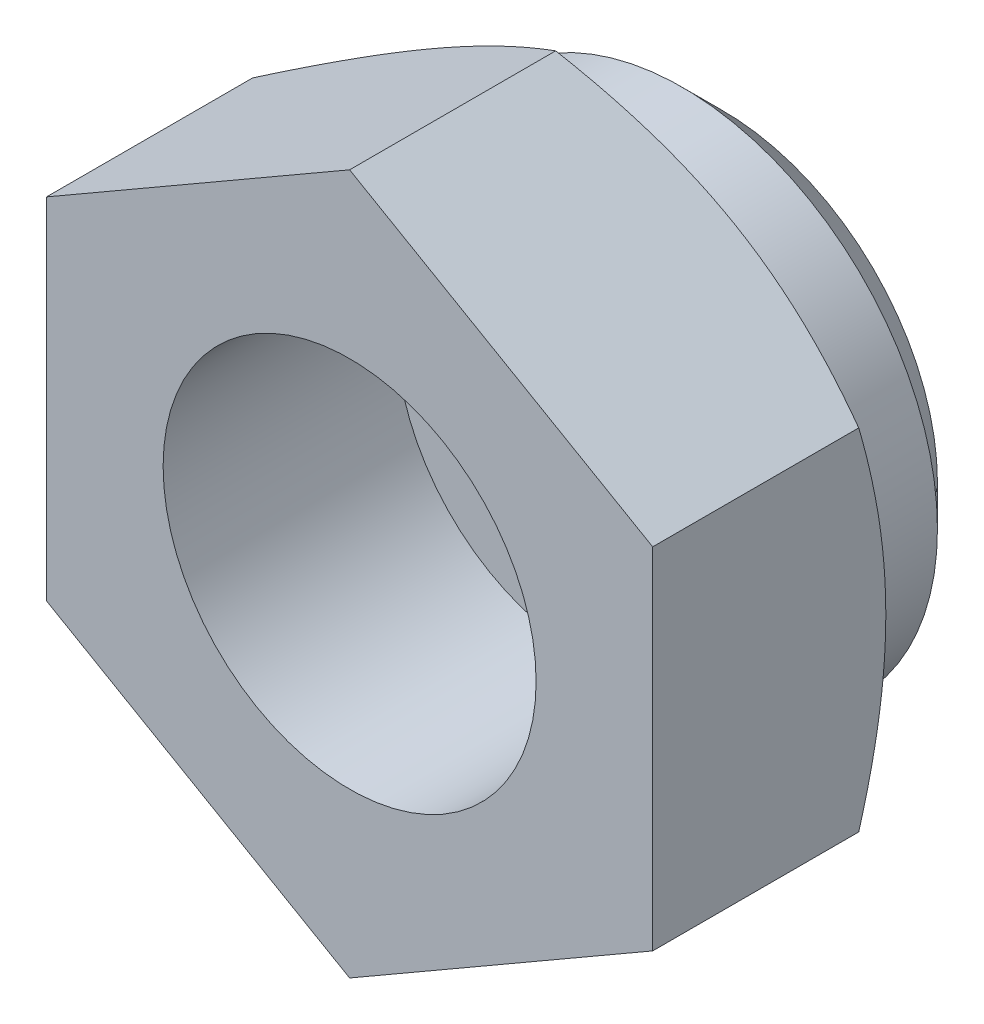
ISO-10303-21;
HEADER;
FILE_DESCRIPTION(('STEP AP214'),'2;1');
FILE_NAME('part.step','',(''),(''),'','','');
FILE_SCHEMA(('AUTOMOTIVE_DESIGN { 1 0 10303 214 1 1 1 1 }'));
ENDSEC;
DATA;
#1=APPLICATION_CONTEXT('core data for automotive mechanical design processes');
#2=APPLICATION_PROTOCOL_DEFINITION('international standard','automotive_design',2000,#1);
#3=PRODUCT_CONTEXT('',#1,'mechanical');
#4=PRODUCT('Part','Part','',(#3));
#5=PRODUCT_RELATED_PRODUCT_CATEGORY('part','',(#4));
#6=PRODUCT_DEFINITION_FORMATION('','',#4);
#7=PRODUCT_DEFINITION_CONTEXT('part definition',#1,'design');
#8=PRODUCT_DEFINITION('design','',#6,#7);
#9=PRODUCT_DEFINITION_SHAPE('','',#8);
#10=(LENGTH_UNIT() NAMED_UNIT(*) SI_UNIT(.MILLI.,.METRE.));
#11=(NAMED_UNIT(*) PLANE_ANGLE_UNIT() SI_UNIT($,.RADIAN.));
#12=(NAMED_UNIT(*) SI_UNIT($,.STERADIAN.) SOLID_ANGLE_UNIT());
#13=UNCERTAINTY_MEASURE_WITH_UNIT(LENGTH_MEASURE(1.E-05),#10,'distance_accuracy_value','');
#14=(GEOMETRIC_REPRESENTATION_CONTEXT(3) GLOBAL_UNCERTAINTY_ASSIGNED_CONTEXT((#13)) GLOBAL_UNIT_ASSIGNED_CONTEXT((#10,
#11,#12)) REPRESENTATION_CONTEXT('',''));
#15=CARTESIAN_POINT('',(0.,0.,0.));
#16=DIRECTION('',(0.,0.,1.));
#17=DIRECTION('',(1.,0.,0.));
#18=AXIS2_PLACEMENT_3D('',#15,#16,#17);
#19=CARTESIAN_POINT('',(6.5,3.75277674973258,-7.));
#20=DIRECTION('',(0.499999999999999,0.866025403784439,0.));
#21=DIRECTION('',(-0.866025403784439,0.499999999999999,0.));
#22=AXIS2_PLACEMENT_3D('',#19,#20,#21);
#23=PLANE('',#22);
#24=DIRECTION('',(0.,0.,1.));
#25=VECTOR('',#24,1.);
#26=CARTESIAN_POINT('',(0.,7.50555349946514,-7.));
#27=LINE('',#26,#25);
#28=CARTESIAN_POINT('',(0.,7.50555349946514,-6.41944341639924));
#29=VERTEX_POINT('',#28);
#30=CARTESIAN_POINT('',(0.,7.50555349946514,-2.));
#31=VERTEX_POINT('',#30);
#32=EDGE_CURVE('E125',#29,#31,#27,.T.);
#33=ORIENTED_EDGE('',*,*,#32,.T.);
#34=DIRECTION('',(0.866025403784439,-0.499999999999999,0.));
#35=VECTOR('',#34,1.);
#36=CARTESIAN_POINT('',(6.5,3.75277674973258,-2.));
#37=LINE('',#36,#35);
#38=CARTESIAN_POINT('',(6.5,3.75277674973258,-2.));
#39=VERTEX_POINT('',#38);
#40=EDGE_CURVE('E45',#31,#39,#37,.T.);
#41=ORIENTED_EDGE('',*,*,#40,.T.);
#42=DIRECTION('',(0.,0.,1.));
#43=VECTOR('',#42,1.);
#44=CARTESIAN_POINT('',(6.5,3.75277674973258,-7.));
#45=LINE('',#44,#43);
#46=CARTESIAN_POINT('',(6.5,3.75277674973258,-6.41944341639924));
#47=VERTEX_POINT('',#46);
#48=EDGE_CURVE('E137',#47,#39,#45,.T.);
#49=ORIENTED_EDGE('',*,*,#48,.F.);
#50=CARTESIAN_POINT('',(-0.0002,7.50566896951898,-6.41937674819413));
#51=CARTESIAN_POINT('',(0.142677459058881,7.42317863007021,-6.46699557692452));
#52=CARTESIAN_POINT('',(0.286087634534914,7.34038072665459,-6.5124532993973));
#53=CARTESIAN_POINT('',(0.574072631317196,7.17411251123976,-6.59845131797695));
#54=CARTESIAN_POINT('',(0.718647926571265,7.09064192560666,-6.63898949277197));
#55=CARTESIAN_POINT('',(1.15468865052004,6.8388936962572,-6.75242899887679));
#56=CARTESIAN_POINT('',(1.44787528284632,6.66962231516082,-6.81695219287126));
#57=CARTESIAN_POINT('',(1.88662374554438,6.41631077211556,-6.89261341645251));
#58=CARTESIAN_POINT('',(2.03087463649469,6.33302748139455,-6.91416714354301));
#59=CARTESIAN_POINT('',(2.32002821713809,6.16608458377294,-6.95030968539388));
#60=CARTESIAN_POINT('',(2.46493084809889,6.08242501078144,-6.96489911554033));
#61=CARTESIAN_POINT('',(2.75498777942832,5.91496056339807,-6.98674124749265));
#62=CARTESIAN_POINT('',(2.90014160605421,5.83115596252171,-6.99400227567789));
#63=CARTESIAN_POINT('',(3.19057533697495,5.66347396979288,-7.00103969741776));
#64=CARTESIAN_POINT('',(3.33585523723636,5.57959658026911,-7.00081632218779));
#65=CARTESIAN_POINT('',(3.7338759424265,5.34979921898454,-6.98991654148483));
#66=CARTESIAN_POINT('',(3.98648646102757,5.20395446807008,-6.97161818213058));
#67=CARTESIAN_POINT('',(4.49002967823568,4.91323365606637,-6.91359365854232));
#68=CARTESIAN_POINT('',(4.74096060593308,4.76835861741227,-6.87384766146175));
#69=CARTESIAN_POINT('',(5.24551722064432,4.47705272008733,-6.77449409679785));
#70=CARTESIAN_POINT('',(5.49907924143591,4.33065861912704,-6.71446557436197));
#71=CARTESIAN_POINT('',(6.00242193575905,4.04005357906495,-6.57822500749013));
#72=CARTESIAN_POINT('',(6.25220905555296,3.89583891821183,-6.50204496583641));
#73=CARTESIAN_POINT('',(6.5002,3.75266127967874,-6.41937674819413));
#74=B_SPLINE_CURVE_WITH_KNOTS('',3,(#50,#51,#52,#53,#54,#55,#56,#57,#58,#59,#60,#61,#62,#63,#64,
#65,#66,#67,#68,#69,#70,#71,#72,#73),.UNSPECIFIED.,.F.,.F.,(4,2,2,2,2,2,2,2,2,2,2,4),(0.,
0.515105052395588,1.03043143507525,2.06322554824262,2.56697389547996,3.07067772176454,
3.57380860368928,4.0769239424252,4.9527935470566,5.82947446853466,6.72559912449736,
7.61996451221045),.UNSPECIFIED.);
#75=CARTESIAN_POINT('',(3.25,5.62916512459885,-7.));
#76=VERTEX_POINT('',#75);
#77=EDGE_CURVE('E140',#76,#47,#74,.T.);
#78=ORIENTED_EDGE('',*,*,#77,.F.);
#79=EDGE_CURVE('E129',#29,#76,#74,.T.);
#80=ORIENTED_EDGE('',*,*,#79,.F.);
#81=EDGE_LOOP('',(#33,#41,#49,#78,#80));
#82=FACE_BOUND('',#81,.T.);
#83=ADVANCED_FACE('F28',(#82),#23,.T.);
#84=CARTESIAN_POINT('',(6.5,-3.75277674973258,-7.));
#85=DIRECTION('',(1.,0.,0.));
#86=DIRECTION('',(0.,0.,-1.));
#87=AXIS2_PLACEMENT_3D('',#84,#85,#86);
#88=PLANE('',#87);
#89=ORIENTED_EDGE('',*,*,#48,.T.);
#90=DIRECTION('',(0.,-1.,0.));
#91=VECTOR('',#90,1.);
#92=CARTESIAN_POINT('',(6.5,-3.75277674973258,-2.));
#93=LINE('',#92,#91);
#94=CARTESIAN_POINT('',(6.5,-3.75277674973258,-2.));
#95=VERTEX_POINT('',#94);
#96=EDGE_CURVE('E248',#39,#95,#93,.T.);
#97=ORIENTED_EDGE('',*,*,#96,.T.);
#98=DIRECTION('',(0.,0.,1.));
#99=VECTOR('',#98,1.);
#100=CARTESIAN_POINT('',(6.5,-3.75277674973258,-7.));
#101=LINE('',#100,#99);
#102=CARTESIAN_POINT('',(6.5,-3.75277674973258,-6.41944341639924));
#103=VERTEX_POINT('',#102);
#104=EDGE_CURVE('E134',#103,#95,#101,.T.);
#105=ORIENTED_EDGE('',*,*,#104,.F.);
#106=CARTESIAN_POINT('',(6.5,-10.1160383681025,-3.81053330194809));
#107=CARTESIAN_POINT('',(6.5,-9.83179995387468,-3.94855726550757));
#108=CARTESIAN_POINT('',(6.5,-9.5469127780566,-4.08526790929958));
#109=CARTESIAN_POINT('',(6.5,-8.97549596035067,-4.35532449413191));
#110=CARTESIAN_POINT('',(6.5,-8.68896607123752,-4.48866991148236));
#111=CARTESIAN_POINT('',(6.5,-8.11246010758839,-4.7519210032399));
#112=CARTESIAN_POINT('',(6.5,-7.82247378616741,-4.8818043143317));
#113=CARTESIAN_POINT('',(6.5,-7.24020663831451,-5.13630181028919));
#114=CARTESIAN_POINT('',(6.5,-6.94792592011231,-5.26091624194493));
#115=CARTESIAN_POINT('',(6.5,-6.35111772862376,-5.50740427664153));
#116=CARTESIAN_POINT('',(6.5,-6.04649955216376,-5.62905945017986));
#117=CARTESIAN_POINT('',(6.5,-5.43371251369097,-5.86324833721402));
#118=CARTESIAN_POINT('',(6.5,-5.12554325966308,-5.9757810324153));
#119=CARTESIAN_POINT('',(6.5,-4.5057299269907,-6.18879780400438));
#120=CARTESIAN_POINT('',(6.5,-4.19409420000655,-6.28930594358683));
#121=CARTESIAN_POINT('',(6.5,-3.56634963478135,-6.47507127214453));
#122=CARTESIAN_POINT('',(6.5,-3.25024222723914,-6.56033322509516));
#123=CARTESIAN_POINT('',(6.5,-2.61510893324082,-6.71109734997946));
#124=CARTESIAN_POINT('',(6.5,-2.29610858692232,-6.77670540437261));
#125=CARTESIAN_POINT('',(6.5,-1.65405934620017,-6.88444825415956));
#126=CARTESIAN_POINT('',(6.5,-1.33101086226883,-6.92658541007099));
#127=CARTESIAN_POINT('',(6.5,-0.846837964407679,-6.96939161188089));
#128=CARTESIAN_POINT('',(6.5,-0.686575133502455,-6.98025429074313));
#129=CARTESIAN_POINT('',(6.5,-0.365726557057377,-6.99519653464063));
#130=CARTESIAN_POINT('',(6.5,-0.205140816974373,-6.99927621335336));
#131=CARTESIAN_POINT('',(6.5,0.116058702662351,-7.00054757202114));
#132=CARTESIAN_POINT('',(6.5,0.276672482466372,-6.99773918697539));
#133=CARTESIAN_POINT('',(6.5,0.597638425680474,-6.98530543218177));
#134=CARTESIAN_POINT('',(6.5,0.757990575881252,-6.97567972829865));
#135=CARTESIAN_POINT('',(6.5,1.14221658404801,-6.94465140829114));
#136=CARTESIAN_POINT('',(6.5,1.36583982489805,-6.9200779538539));
#137=CARTESIAN_POINT('',(6.5,1.81144009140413,-6.85900356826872));
#138=CARTESIAN_POINT('',(6.5,2.03341689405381,-6.82250105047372));
#139=CARTESIAN_POINT('',(6.5,2.69661009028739,-6.69703435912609));
#140=CARTESIAN_POINT('',(6.5,3.13485196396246,-6.59213276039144));
#141=CARTESIAN_POINT('',(6.5,3.79033354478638,-6.41001364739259));
#142=CARTESIAN_POINT('',(6.5,4.0109652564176,-6.34430135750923));
#143=CARTESIAN_POINT('',(6.5,4.45008542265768,-6.20600454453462));
#144=CARTESIAN_POINT('',(6.5,4.66857386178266,-6.13341997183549));
#145=CARTESIAN_POINT('',(6.5,5.10347731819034,-5.98254737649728));
#146=CARTESIAN_POINT('',(6.5,5.31989296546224,-5.9042611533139));
#147=CARTESIAN_POINT('',(6.5,5.75092589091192,-5.74291130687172));
#148=CARTESIAN_POINT('',(6.5,5.96554320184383,-5.65984777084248));
#149=CARTESIAN_POINT('',(6.5,6.51690005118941,-5.44052675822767));
#150=CARTESIAN_POINT('',(6.5,6.85245589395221,-5.30129722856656));
#151=CARTESIAN_POINT('',(6.5,7.52035427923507,-5.01530826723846));
#152=CARTESIAN_POINT('',(6.5,7.85269653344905,-4.86854816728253));
#153=CARTESIAN_POINT('',(6.5,8.51485699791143,-4.56918574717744));
#154=CARTESIAN_POINT('',(6.5,8.84467438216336,-4.41658160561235));
#155=CARTESIAN_POINT('',(6.5,9.50215983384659,-4.10685180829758));
#156=CARTESIAN_POINT('',(6.5,9.82982796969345,-3.94972629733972));
#157=CARTESIAN_POINT('',(6.5,10.4838715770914,-3.63167086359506));
#158=CARTESIAN_POINT('',(6.5,10.810244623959,-3.47073596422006));
#159=CARTESIAN_POINT('',(6.5,11.4615496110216,-3.14597586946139));
#160=CARTESIAN_POINT('',(6.5,11.7864815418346,-2.98215065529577));
#161=CARTESIAN_POINT('',(6.5,12.7593807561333,-2.48724272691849));
#162=CARTESIAN_POINT('',(6.5,13.405571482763,-2.15266882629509));
#163=CARTESIAN_POINT('',(6.5,14.6317786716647,-1.51012519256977));
#164=CARTESIAN_POINT('',(6.5,15.2121040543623,-1.20274223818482));
#165=CARTESIAN_POINT('',(6.5,16.3707490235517,-0.584151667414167));
#166=CARTESIAN_POINT('',(6.5,16.9490685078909,-0.272943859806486));
#167=CARTESIAN_POINT('',(6.5,18.1024390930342,0.351398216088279));
#168=CARTESIAN_POINT('',(6.5,18.6774947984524,0.66452399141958));
#169=CARTESIAN_POINT('',(6.5,19.8263474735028,1.29298475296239));
#170=CARTESIAN_POINT('',(6.5,20.4001445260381,1.60831958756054));
#171=CARTESIAN_POINT('',(6.5,20.973491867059,1.92446481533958));
#172=B_SPLINE_CURVE_WITH_KNOTS('',3,(#106,#107,#108,#109,#110,#111,#112,#113,#114,#115,#116,
#117,#118,#119,#120,#121,#122,#123,#124,#125,#126,#127,#128,#129,#130,#131,#132,#133,#134,#135,
#136,#137,#138,#139,#140,#141,#142,#143,#144,#145,#146,#147,#148,#149,#150,#151,#152,#153,#154,
#155,#156,#157,#158,#159,#160,#161,#162,#163,#164,#165,#166,#167,#168,#169,#170,#171),
.UNSPECIFIED.,.F.,.F.,(4,2,2,2,2,2,2,2,2,2,2,2,2,2,2,2,2,2,2,2,2,2,2,2,2,2,2,2,2,2,2,2,4),(0.,
0.947945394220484,1.89603740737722,2.84922974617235,3.80237738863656,4.78630213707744,
5.77033656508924,6.75236761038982,7.73409126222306,8.71042676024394,9.6866640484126,
10.1684339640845,10.6501958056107,11.1319621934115,11.6137521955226,12.2882801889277,
12.9628979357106,14.3128451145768,15.0034153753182,15.6939906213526,16.3843488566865,
17.0746944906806,18.1644438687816,19.2542901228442,20.3444788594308,21.4346327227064,
22.5262993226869,23.6179730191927,25.8009193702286,27.7710204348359,29.741220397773,
31.7055551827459,33.6697564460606),.UNSPECIFIED.);
#173=CARTESIAN_POINT('',(6.5,0.,-7.));
#174=VERTEX_POINT('',#173);
#175=EDGE_CURVE('E147',#174,#103,#172,.F.);
#176=ORIENTED_EDGE('',*,*,#175,.F.);
#177=EDGE_CURVE('E146',#47,#174,#172,.F.);
#178=ORIENTED_EDGE('',*,*,#177,.F.);
#179=EDGE_LOOP('',(#89,#97,#105,#176,#178));
#180=FACE_BOUND('',#179,.T.);
#181=ADVANCED_FACE('F197',(#180),#88,.T.);
#182=CARTESIAN_POINT('',(6.5,-3.75277674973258,-7.));
#183=DIRECTION('',(0.499999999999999,-0.866025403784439,0.));
#184=DIRECTION('',(0.866025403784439,0.499999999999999,0.));
#185=AXIS2_PLACEMENT_3D('',#182,#183,#184);
#186=PLANE('',#185);
#187=ORIENTED_EDGE('',*,*,#104,.T.);
#188=DIRECTION('',(-0.866025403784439,-0.499999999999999,0.));
#189=VECTOR('',#188,1.);
#190=CARTESIAN_POINT('',(6.5,-3.75277674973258,-2.));
#191=LINE('',#190,#189);
#192=CARTESIAN_POINT('',(0.,-7.50555349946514,-2.));
#193=VERTEX_POINT('',#192);
#194=EDGE_CURVE('E251',#95,#193,#191,.T.);
#195=ORIENTED_EDGE('',*,*,#194,.T.);
#196=DIRECTION('',(0.,0.,1.));
#197=VECTOR('',#196,1.);
#198=CARTESIAN_POINT('',(0.,-7.50555349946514,-7.));
#199=LINE('',#198,#197);
#200=CARTESIAN_POINT('',(0.,-7.50555349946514,-6.41944341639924));
#201=VERTEX_POINT('',#200);
#202=EDGE_CURVE('E127',#201,#193,#199,.T.);
#203=ORIENTED_EDGE('',*,*,#202,.F.);
#204=CARTESIAN_POINT('',(6.5002,-3.75266127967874,-6.41937674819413));
#205=CARTESIAN_POINT('',(6.35732254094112,-3.83515161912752,-6.46699557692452));
#206=CARTESIAN_POINT('',(6.21391236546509,-3.91794952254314,-6.51245329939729));
#207=CARTESIAN_POINT('',(5.9259273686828,-4.08421773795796,-6.59845131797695));
#208=CARTESIAN_POINT('',(5.78135207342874,-4.16768832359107,-6.63898949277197));
#209=CARTESIAN_POINT('',(5.34531134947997,-4.41943655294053,-6.75242899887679));
#210=CARTESIAN_POINT('',(5.05212471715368,-4.58870793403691,-6.81695219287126));
#211=CARTESIAN_POINT('',(4.61337625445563,-4.84201947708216,-6.89261341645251));
#212=CARTESIAN_POINT('',(4.46912536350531,-4.92530276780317,-6.91416714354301));
#213=CARTESIAN_POINT('',(4.17997178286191,-5.09224566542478,-6.95030968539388));
#214=CARTESIAN_POINT('',(4.03506915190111,-5.17590523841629,-6.96489911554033));
#215=CARTESIAN_POINT('',(3.74501222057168,-5.34336968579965,-6.98674124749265));
#216=CARTESIAN_POINT('',(3.59985839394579,-5.42717428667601,-6.99400227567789));
#217=CARTESIAN_POINT('',(3.30942466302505,-5.59485627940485,-7.00103969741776));
#218=CARTESIAN_POINT('',(3.16414476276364,-5.67873366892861,-7.00081632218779));
#219=CARTESIAN_POINT('',(2.76612405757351,-5.90853103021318,-6.98991654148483));
#220=CARTESIAN_POINT('',(2.51351353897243,-6.05437578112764,-6.97161818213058));
#221=CARTESIAN_POINT('',(2.00997032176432,-6.34509659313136,-6.91359365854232));
#222=CARTESIAN_POINT('',(1.75903939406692,-6.48997163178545,-6.87384766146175));
#223=CARTESIAN_POINT('',(1.25448277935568,-6.78127752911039,-6.77449409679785));
#224=CARTESIAN_POINT('',(1.00092075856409,-6.92767163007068,-6.71446557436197));
#225=CARTESIAN_POINT('',(0.497578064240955,-7.21827667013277,-6.57822500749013));
#226=CARTESIAN_POINT('',(0.247790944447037,-7.3624913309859,-6.50204496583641));
#227=CARTESIAN_POINT('',(-0.00019999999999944,-7.50566896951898,-6.41937674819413));
#228=B_SPLINE_CURVE_WITH_KNOTS('',3,(#204,#205,#206,#207,#208,#209,#210,#211,#212,#213,#214,
#215,#216,#217,#218,#219,#220,#221,#222,#223,#224,#225,#226,#227),.UNSPECIFIED.,.F.,.F.,(4,2,2,
2,2,2,2,2,2,2,2,4),(0.,0.515105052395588,1.03043143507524,2.06322554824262,2.56697389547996,
3.07067772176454,3.57380860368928,4.0769239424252,4.9527935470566,5.82947446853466,
6.72559912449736,7.61996451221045),.UNSPECIFIED.);
#229=CARTESIAN_POINT('',(3.25,-5.62916512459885,-7.));
#230=VERTEX_POINT('',#229);
#231=EDGE_CURVE('E187',#230,#201,#228,.T.);
#232=ORIENTED_EDGE('',*,*,#231,.F.);
#233=EDGE_CURVE('E192',#103,#230,#228,.T.);
#234=ORIENTED_EDGE('',*,*,#233,.F.);
#235=EDGE_LOOP('',(#187,#195,#203,#232,#234));
#236=FACE_BOUND('',#235,.T.);
#237=ADVANCED_FACE('F193',(#236),#186,.T.);
#238=CARTESIAN_POINT('',(-6.5,-3.75277674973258,-7.));
#239=DIRECTION('',(-0.499999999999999,-0.866025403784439,0.));
#240=DIRECTION('',(0.866025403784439,-0.499999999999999,0.));
#241=AXIS2_PLACEMENT_3D('',#238,#239,#240);
#242=PLANE('',#241);
#243=ORIENTED_EDGE('',*,*,#202,.T.);
#244=DIRECTION('',(-0.866025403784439,0.499999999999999,0.));
#245=VECTOR('',#244,1.);
#246=CARTESIAN_POINT('',(-6.5,-3.75277674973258,-2.));
#247=LINE('',#246,#245);
#248=CARTESIAN_POINT('',(-6.5,-3.75277674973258,-2.));
#249=VERTEX_POINT('',#248);
#250=EDGE_CURVE('E118',#193,#249,#247,.T.);
#251=ORIENTED_EDGE('',*,*,#250,.T.);
#252=DIRECTION('',(0.,0.,1.));
#253=VECTOR('',#252,1.);
#254=CARTESIAN_POINT('',(-6.5,-3.75277674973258,-7.));
#255=LINE('',#254,#253);
#256=CARTESIAN_POINT('',(-6.5,-3.75277674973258,-6.41944341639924));
#257=VERTEX_POINT('',#256);
#258=EDGE_CURVE('E117',#257,#249,#255,.T.);
#259=ORIENTED_EDGE('',*,*,#258,.F.);
#260=CARTESIAN_POINT('',(0.0002,-7.50566896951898,-6.41937674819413));
#261=CARTESIAN_POINT('',(-0.142677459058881,-7.42317863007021,-6.46699557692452));
#262=CARTESIAN_POINT('',(-0.286087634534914,-7.34038072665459,-6.5124532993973));
#263=CARTESIAN_POINT('',(-0.574072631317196,-7.17411251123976,-6.59845131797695));
#264=CARTESIAN_POINT('',(-0.718647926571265,-7.09064192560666,-6.63898949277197));
#265=CARTESIAN_POINT('',(-1.15468865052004,-6.8388936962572,-6.75242899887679));
#266=CARTESIAN_POINT('',(-1.44787528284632,-6.66962231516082,-6.81695219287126));
#267=CARTESIAN_POINT('',(-1.88662374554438,-6.41631077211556,-6.89261341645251));
#268=CARTESIAN_POINT('',(-2.03087463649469,-6.33302748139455,-6.91416714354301));
#269=CARTESIAN_POINT('',(-2.32002821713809,-6.16608458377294,-6.95030968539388));
#270=CARTESIAN_POINT('',(-2.46493084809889,-6.08242501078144,-6.96489911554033));
#271=CARTESIAN_POINT('',(-2.75498777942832,-5.91496056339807,-6.98674124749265));
#272=CARTESIAN_POINT('',(-2.90014160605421,-5.83115596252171,-6.99400227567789));
#273=CARTESIAN_POINT('',(-3.19057533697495,-5.66347396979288,-7.00103969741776));
#274=CARTESIAN_POINT('',(-3.33585523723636,-5.57959658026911,-7.00081632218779));
#275=CARTESIAN_POINT('',(-3.7338759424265,-5.34979921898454,-6.98991654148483));
#276=CARTESIAN_POINT('',(-3.98648646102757,-5.20395446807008,-6.97161818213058));
#277=CARTESIAN_POINT('',(-4.49002967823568,-4.91323365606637,-6.91359365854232));
#278=CARTESIAN_POINT('',(-4.74096060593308,-4.76835861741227,-6.87384766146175));
#279=CARTESIAN_POINT('',(-5.24551722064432,-4.47705272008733,-6.77449409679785));
#280=CARTESIAN_POINT('',(-5.49907924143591,-4.33065861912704,-6.71446557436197));
#281=CARTESIAN_POINT('',(-6.00242193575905,-4.04005357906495,-6.57822500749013));
#282=CARTESIAN_POINT('',(-6.25220905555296,-3.89583891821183,-6.50204496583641));
#283=CARTESIAN_POINT('',(-6.5002,-3.75266127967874,-6.41937674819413));
#284=B_SPLINE_CURVE_WITH_KNOTS('',3,(#260,#261,#262,#263,#264,#265,#266,#267,#268,#269,#270,
#271,#272,#273,#274,#275,#276,#277,#278,#279,#280,#281,#282,#283),.UNSPECIFIED.,.F.,.F.,(4,2,2,
2,2,2,2,2,2,2,2,4),(0.,0.515105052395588,1.03043143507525,2.06322554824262,2.56697389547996,
3.07067772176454,3.57380860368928,4.0769239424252,4.9527935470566,5.82947446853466,
6.72559912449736,7.61996451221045),.UNSPECIFIED.);
#285=CARTESIAN_POINT('',(-3.25,-5.62916512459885,-7.));
#286=VERTEX_POINT('',#285);
#287=EDGE_CURVE('E182',#286,#257,#284,.T.);
#288=ORIENTED_EDGE('',*,*,#287,.F.);
#289=EDGE_CURVE('E53',#201,#286,#284,.T.);
#290=ORIENTED_EDGE('',*,*,#289,.F.);
#291=EDGE_LOOP('',(#243,#251,#259,#288,#290));
#292=FACE_BOUND('',#291,.T.);
#293=ADVANCED_FACE('F196',(#292),#242,.T.);
#294=CARTESIAN_POINT('',(-6.5,-3.75277674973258,-7.));
#295=DIRECTION('',(-1.,0.,0.));
#296=DIRECTION('',(0.,0.,1.));
#297=AXIS2_PLACEMENT_3D('',#294,#295,#296);
#298=PLANE('',#297);
#299=ORIENTED_EDGE('',*,*,#258,.T.);
#300=DIRECTION('',(0.,1.,0.));
#301=VECTOR('',#300,1.);
#302=CARTESIAN_POINT('',(-6.5,-3.75277674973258,-2.));
#303=LINE('',#302,#301);
#304=CARTESIAN_POINT('',(-6.5,3.75277674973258,-2.));
#305=VERTEX_POINT('',#304);
#306=EDGE_CURVE('E102',#249,#305,#303,.T.);
#307=ORIENTED_EDGE('',*,*,#306,.T.);
#308=DIRECTION('',(0.,0.,1.));
#309=VECTOR('',#308,1.);
#310=CARTESIAN_POINT('',(-6.5,3.75277674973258,-7.));
#311=LINE('',#310,#309);
#312=CARTESIAN_POINT('',(-6.5,3.75277674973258,-6.41944341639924));
#313=VERTEX_POINT('',#312);
#314=EDGE_CURVE('E114',#313,#305,#311,.T.);
#315=ORIENTED_EDGE('',*,*,#314,.F.);
#316=CARTESIAN_POINT('',(-6.5,-10.1160383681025,-3.81053330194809));
#317=CARTESIAN_POINT('',(-6.5,-9.83179995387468,-3.94855726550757));
#318=CARTESIAN_POINT('',(-6.5,-9.5469127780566,-4.08526790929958));
#319=CARTESIAN_POINT('',(-6.5,-8.97549596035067,-4.35532449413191));
#320=CARTESIAN_POINT('',(-6.5,-8.68896607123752,-4.48866991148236));
#321=CARTESIAN_POINT('',(-6.5,-8.11246010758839,-4.7519210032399));
#322=CARTESIAN_POINT('',(-6.5,-7.82247378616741,-4.8818043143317));
#323=CARTESIAN_POINT('',(-6.5,-7.24020663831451,-5.13630181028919));
#324=CARTESIAN_POINT('',(-6.5,-6.94792592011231,-5.26091624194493));
#325=CARTESIAN_POINT('',(-6.5,-6.35111772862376,-5.50740427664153));
#326=CARTESIAN_POINT('',(-6.5,-6.04649955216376,-5.62905945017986));
#327=CARTESIAN_POINT('',(-6.5,-5.43371251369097,-5.86324833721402));
#328=CARTESIAN_POINT('',(-6.5,-5.12554325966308,-5.9757810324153));
#329=CARTESIAN_POINT('',(-6.5,-4.5057299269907,-6.18879780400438));
#330=CARTESIAN_POINT('',(-6.5,-4.19409420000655,-6.28930594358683));
#331=CARTESIAN_POINT('',(-6.5,-3.56634963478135,-6.47507127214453));
#332=CARTESIAN_POINT('',(-6.5,-3.25024222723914,-6.56033322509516));
#333=CARTESIAN_POINT('',(-6.5,-2.61510893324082,-6.71109734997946));
#334=CARTESIAN_POINT('',(-6.5,-2.29610858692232,-6.77670540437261));
#335=CARTESIAN_POINT('',(-6.5,-1.65405934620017,-6.88444825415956));
#336=CARTESIAN_POINT('',(-6.5,-1.33101086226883,-6.92658541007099));
#337=CARTESIAN_POINT('',(-6.5,-0.846837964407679,-6.96939161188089));
#338=CARTESIAN_POINT('',(-6.5,-0.686575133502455,-6.98025429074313));
#339=CARTESIAN_POINT('',(-6.5,-0.365726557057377,-6.99519653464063));
#340=CARTESIAN_POINT('',(-6.5,-0.205140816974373,-6.99927621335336));
#341=CARTESIAN_POINT('',(-6.5,0.116058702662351,-7.00054757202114));
#342=CARTESIAN_POINT('',(-6.5,0.276672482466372,-6.99773918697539));
#343=CARTESIAN_POINT('',(-6.5,0.597638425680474,-6.98530543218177));
#344=CARTESIAN_POINT('',(-6.5,0.757990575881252,-6.97567972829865));
#345=CARTESIAN_POINT('',(-6.5,1.14221658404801,-6.94465140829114));
#346=CARTESIAN_POINT('',(-6.5,1.36583982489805,-6.9200779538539));
#347=CARTESIAN_POINT('',(-6.5,1.81144009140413,-6.85900356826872));
#348=CARTESIAN_POINT('',(-6.5,2.03341689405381,-6.82250105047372));
#349=CARTESIAN_POINT('',(-6.5,2.69661009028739,-6.69703435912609));
#350=CARTESIAN_POINT('',(-6.5,3.13485196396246,-6.59213276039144));
#351=CARTESIAN_POINT('',(-6.5,3.79033354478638,-6.41001364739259));
#352=CARTESIAN_POINT('',(-6.5,4.0109652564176,-6.34430135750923));
#353=CARTESIAN_POINT('',(-6.5,4.45008542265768,-6.20600454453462));
#354=CARTESIAN_POINT('',(-6.5,4.66857386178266,-6.13341997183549));
#355=CARTESIAN_POINT('',(-6.5,5.10347731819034,-5.98254737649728));
#356=CARTESIAN_POINT('',(-6.5,5.31989296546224,-5.9042611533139));
#357=CARTESIAN_POINT('',(-6.5,5.75092589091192,-5.74291130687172));
#358=CARTESIAN_POINT('',(-6.5,5.96554320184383,-5.65984777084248));
#359=CARTESIAN_POINT('',(-6.5,6.51690005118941,-5.44052675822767));
#360=CARTESIAN_POINT('',(-6.5,6.85245589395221,-5.30129722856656));
#361=CARTESIAN_POINT('',(-6.5,7.52035427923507,-5.01530826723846));
#362=CARTESIAN_POINT('',(-6.5,7.85269653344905,-4.86854816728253));
#363=CARTESIAN_POINT('',(-6.5,8.51485699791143,-4.56918574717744));
#364=CARTESIAN_POINT('',(-6.5,8.84467438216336,-4.41658160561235));
#365=CARTESIAN_POINT('',(-6.5,9.50215983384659,-4.10685180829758));
#366=CARTESIAN_POINT('',(-6.5,9.82982796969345,-3.94972629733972));
#367=CARTESIAN_POINT('',(-6.5,10.4838715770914,-3.63167086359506));
#368=CARTESIAN_POINT('',(-6.5,10.810244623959,-3.47073596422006));
#369=CARTESIAN_POINT('',(-6.5,11.4615496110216,-3.14597586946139));
#370=CARTESIAN_POINT('',(-6.5,11.7864815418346,-2.98215065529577));
#371=CARTESIAN_POINT('',(-6.5,12.7593807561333,-2.48724272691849));
#372=CARTESIAN_POINT('',(-6.5,13.405571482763,-2.15266882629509));
#373=CARTESIAN_POINT('',(-6.5,14.6317786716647,-1.51012519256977));
#374=CARTESIAN_POINT('',(-6.5,15.2121040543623,-1.20274223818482));
#375=CARTESIAN_POINT('',(-6.5,16.3707490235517,-0.584151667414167));
#376=CARTESIAN_POINT('',(-6.5,16.9490685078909,-0.272943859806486));
#377=CARTESIAN_POINT('',(-6.5,18.1024390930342,0.351398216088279));
#378=CARTESIAN_POINT('',(-6.5,18.6774947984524,0.66452399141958));
#379=CARTESIAN_POINT('',(-6.5,19.8263474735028,1.29298475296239));
#380=CARTESIAN_POINT('',(-6.5,20.4001445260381,1.60831958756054));
#381=CARTESIAN_POINT('',(-6.5,20.973491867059,1.92446481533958));
#382=B_SPLINE_CURVE_WITH_KNOTS('',3,(#316,#317,#318,#319,#320,#321,#322,#323,#324,#325,#326,
#327,#328,#329,#330,#331,#332,#333,#334,#335,#336,#337,#338,#339,#340,#341,#342,#343,#344,#345,
#346,#347,#348,#349,#350,#351,#352,#353,#354,#355,#356,#357,#358,#359,#360,#361,#362,#363,#364,
#365,#366,#367,#368,#369,#370,#371,#372,#373,#374,#375,#376,#377,#378,#379,#380,#381),
.UNSPECIFIED.,.F.,.F.,(4,2,2,2,2,2,2,2,2,2,2,2,2,2,2,2,2,2,2,2,2,2,2,2,2,2,2,2,2,2,2,2,4),(0.,
0.947945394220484,1.89603740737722,2.84922974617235,3.80237738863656,4.78630213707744,
5.77033656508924,6.75236761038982,7.73409126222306,8.71042676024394,9.6866640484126,
10.1684339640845,10.6501958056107,11.1319621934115,11.6137521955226,12.2882801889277,
12.9628979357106,14.3128451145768,15.0034153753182,15.6939906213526,16.3843488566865,
17.0746944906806,18.1644438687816,19.2542901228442,20.3444788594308,21.4346327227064,
22.5262993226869,23.6179730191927,25.8009193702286,27.7710204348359,29.741220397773,
31.7055551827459,33.6697564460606),.UNSPECIFIED.);
#383=CARTESIAN_POINT('',(-6.5,0.,-7.));
#384=VERTEX_POINT('',#383);
#385=EDGE_CURVE('E175',#384,#313,#382,.T.);
#386=ORIENTED_EDGE('',*,*,#385,.F.);
#387=EDGE_CURVE('E285',#257,#384,#382,.T.);
#388=ORIENTED_EDGE('',*,*,#387,.F.);
#389=EDGE_LOOP('',(#299,#307,#315,#386,#388));
#390=FACE_BOUND('',#389,.T.);
#391=ADVANCED_FACE('F112',(#390),#298,.T.);
#392=CARTESIAN_POINT('',(-6.5,3.75277674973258,-7.));
#393=DIRECTION('',(-0.499999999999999,0.866025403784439,0.));
#394=DIRECTION('',(-0.866025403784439,-0.499999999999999,0.));
#395=AXIS2_PLACEMENT_3D('',#392,#393,#394);
#396=PLANE('',#395);
#397=ORIENTED_EDGE('',*,*,#314,.T.);
#398=DIRECTION('',(0.866025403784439,0.499999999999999,0.));
#399=VECTOR('',#398,1.);
#400=CARTESIAN_POINT('',(-6.5,3.75277674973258,-2.));
#401=LINE('',#400,#399);
#402=EDGE_CURVE('E98',#305,#31,#401,.T.);
#403=ORIENTED_EDGE('',*,*,#402,.T.);
#404=ORIENTED_EDGE('',*,*,#32,.F.);
#405=CARTESIAN_POINT('',(-6.5002,3.75266127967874,-6.41937674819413));
#406=CARTESIAN_POINT('',(-6.35732254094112,3.83515161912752,-6.46699557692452));
#407=CARTESIAN_POINT('',(-6.21391236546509,3.91794952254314,-6.51245329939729));
#408=CARTESIAN_POINT('',(-5.9259273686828,4.08421773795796,-6.59845131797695));
#409=CARTESIAN_POINT('',(-5.78135207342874,4.16768832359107,-6.63898949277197));
#410=CARTESIAN_POINT('',(-5.34531134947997,4.41943655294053,-6.75242899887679));
#411=CARTESIAN_POINT('',(-5.05212471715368,4.58870793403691,-6.81695219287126));
#412=CARTESIAN_POINT('',(-4.61337625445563,4.84201947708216,-6.89261341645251));
#413=CARTESIAN_POINT('',(-4.46912536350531,4.92530276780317,-6.91416714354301));
#414=CARTESIAN_POINT('',(-4.17997178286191,5.09224566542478,-6.95030968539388));
#415=CARTESIAN_POINT('',(-4.03506915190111,5.17590523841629,-6.96489911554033));
#416=CARTESIAN_POINT('',(-3.74501222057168,5.34336968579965,-6.98674124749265));
#417=CARTESIAN_POINT('',(-3.59985839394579,5.42717428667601,-6.99400227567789));
#418=CARTESIAN_POINT('',(-3.30942466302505,5.59485627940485,-7.00103969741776));
#419=CARTESIAN_POINT('',(-3.16414476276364,5.67873366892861,-7.00081632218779));
#420=CARTESIAN_POINT('',(-2.76612405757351,5.90853103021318,-6.98991654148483));
#421=CARTESIAN_POINT('',(-2.51351353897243,6.05437578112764,-6.97161818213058));
#422=CARTESIAN_POINT('',(-2.00997032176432,6.34509659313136,-6.91359365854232));
#423=CARTESIAN_POINT('',(-1.75903939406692,6.48997163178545,-6.87384766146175));
#424=CARTESIAN_POINT('',(-1.25448277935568,6.78127752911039,-6.77449409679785));
#425=CARTESIAN_POINT('',(-1.00092075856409,6.92767163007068,-6.71446557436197));
#426=CARTESIAN_POINT('',(-0.497578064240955,7.21827667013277,-6.57822500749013));
#427=CARTESIAN_POINT('',(-0.247790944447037,7.3624913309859,-6.50204496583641));
#428=CARTESIAN_POINT('',(0.00019999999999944,7.50566896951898,-6.41937674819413));
#429=B_SPLINE_CURVE_WITH_KNOTS('',3,(#405,#406,#407,#408,#409,#410,#411,#412,#413,#414,#415,
#416,#417,#418,#419,#420,#421,#422,#423,#424,#425,#426,#427,#428),.UNSPECIFIED.,.F.,.F.,(4,2,2,
2,2,2,2,2,2,2,2,4),(0.,0.515105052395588,1.03043143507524,2.06322554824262,2.56697389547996,
3.07067772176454,3.57380860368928,4.0769239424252,4.9527935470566,5.82947446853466,
6.72559912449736,7.61996451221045),.UNSPECIFIED.);
#430=CARTESIAN_POINT('',(-3.25,5.62916512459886,-7.));
#431=VERTEX_POINT('',#430);
#432=EDGE_CURVE('E167',#431,#29,#429,.T.);
#433=ORIENTED_EDGE('',*,*,#432,.F.);
#434=EDGE_CURVE('E124',#313,#431,#429,.T.);
#435=ORIENTED_EDGE('',*,*,#434,.F.);
#436=EDGE_LOOP('',(#397,#403,#404,#433,#435));
#437=FACE_BOUND('',#436,.T.);
#438=ADVANCED_FACE('F121',(#437),#396,.T.);
#439=CARTESIAN_POINT('',(-6.5,11.2583302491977,-7.));
#440=DIRECTION('',(0.,0.,-1.));
#441=DIRECTION('',(-1.,0.,0.));
#442=AXIS2_PLACEMENT_3D('',#439,#440,#441);
#443=PLANE('',#442);
#444=CARTESIAN_POINT('',(0.,0.,-7.));
#445=DIRECTION('',(0.,0.,-1.));
#446=DIRECTION('',(-1.,0.,0.));
#447=AXIS2_PLACEMENT_3D('',#444,#445,#446);
#448=CIRCLE('',#447,6.5);
#449=EDGE_CURVE('E11',#384,#286,#448,.F.);
#450=ORIENTED_EDGE('',*,*,#449,.F.);
#451=CARTESIAN_POINT('',(0.,0.,-7.));
#452=DIRECTION('',(0.,0.,-1.));
#453=DIRECTION('',(-1.,0.,0.));
#454=AXIS2_PLACEMENT_3D('',#451,#452,#453);
#455=CIRCLE('',#454,6.5);
#456=EDGE_CURVE('E224',#384,#431,#455,.T.);
#457=ORIENTED_EDGE('',*,*,#456,.T.);
#458=EDGE_CURVE('E38',#76,#431,#448,.F.);
#459=ORIENTED_EDGE('',*,*,#458,.F.);
#460=EDGE_CURVE('E266',#174,#76,#448,.F.);
#461=ORIENTED_EDGE('',*,*,#460,.F.);
#462=EDGE_CURVE('E268',#230,#174,#448,.F.);
#463=ORIENTED_EDGE('',*,*,#462,.F.);
#464=EDGE_CURVE('E37',#286,#230,#448,.F.);
#465=ORIENTED_EDGE('',*,*,#464,.F.);
#466=EDGE_LOOP('',(#450,#457,#459,#461,#463,#465));
#467=FACE_BOUND('',#466,.T.);
#468=CARTESIAN_POINT('',(0.,0.,-7.));
#469=DIRECTION('',(0.,0.,1.));
#470=DIRECTION('',(1.,0.,0.));
#471=AXIS2_PLACEMENT_3D('',#468,#469,#470);
#472=CIRCLE('',#471,5.46955330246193);
#473=CARTESIAN_POINT('',(5.46955330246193,0.,-7.));
#474=VERTEX_POINT('',#473);
#475=EDGE_CURVE('E225',#474,#474,#472,.T.);
#476=ORIENTED_EDGE('',*,*,#475,.T.);
#477=EDGE_LOOP('',(#476));
#478=FACE_BOUND('',#477,.T.);
#479=ADVANCED_FACE('F159',(#467,#478),#443,.T.);
#480=CARTESIAN_POINT('',(0.,0.,-3.5));
#481=DIRECTION('',(0.,0.,1.));
#482=DIRECTION('',(1.,0.,0.));
#483=AXIS2_PLACEMENT_3D('',#480,#481,#482);
#484=CONICAL_SURFACE('',#483,12.5621778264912,1.0471975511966);
#485=ORIENTED_EDGE('',*,*,#385,.T.);
#486=ORIENTED_EDGE('',*,*,#434,.T.);
#487=ORIENTED_EDGE('',*,*,#456,.F.);
#488=EDGE_LOOP('',(#485,#486,#487));
#489=FACE_BOUND('',#488,.T.);
#490=ADVANCED_FACE('F153',(#489),#484,.T.);
#491=ORIENTED_EDGE('',*,*,#79,.T.);
#492=ORIENTED_EDGE('',*,*,#458,.T.);
#493=ORIENTED_EDGE('',*,*,#432,.T.);
#494=EDGE_LOOP('',(#491,#492,#493));
#495=FACE_BOUND('',#494,.T.);
#496=ADVANCED_FACE('F158',(#495),#484,.T.);
#497=ORIENTED_EDGE('',*,*,#77,.T.);
#498=ORIENTED_EDGE('',*,*,#177,.T.);
#499=ORIENTED_EDGE('',*,*,#460,.T.);
#500=EDGE_LOOP('',(#497,#498,#499));
#501=FACE_BOUND('',#500,.T.);
#502=ADVANCED_FACE('F263',(#501),#484,.T.);
#503=ORIENTED_EDGE('',*,*,#175,.T.);
#504=ORIENTED_EDGE('',*,*,#233,.T.);
#505=ORIENTED_EDGE('',*,*,#462,.T.);
#506=EDGE_LOOP('',(#503,#504,#505));
#507=FACE_BOUND('',#506,.T.);
#508=ADVANCED_FACE('F274',(#507),#484,.T.);
#509=ORIENTED_EDGE('',*,*,#231,.T.);
#510=ORIENTED_EDGE('',*,*,#289,.T.);
#511=ORIENTED_EDGE('',*,*,#464,.T.);
#512=EDGE_LOOP('',(#509,#510,#511));
#513=FACE_BOUND('',#512,.T.);
#514=ADVANCED_FACE('F278',(#513),#484,.T.);
#515=ORIENTED_EDGE('',*,*,#287,.T.);
#516=ORIENTED_EDGE('',*,*,#387,.T.);
#517=ORIENTED_EDGE('',*,*,#449,.T.);
#518=EDGE_LOOP('',(#515,#516,#517));
#519=FACE_BOUND('',#518,.T.);
#520=ADVANCED_FACE('F161',(#519),#484,.T.);
#521=CARTESIAN_POINT('',(0.,0.,0.));
#522=DIRECTION('',(0.,0.,1.));
#523=DIRECTION('',(1.,0.,0.));
#524=AXIS2_PLACEMENT_3D('',#521,#522,#523);
#525=CYLINDRICAL_SURFACE('',#524,5.46955330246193);
#526=ORIENTED_EDGE('',*,*,#475,.F.);
#527=EDGE_LOOP('',(#526));
#528=FACE_BOUND('',#527,.T.);
#529=CARTESIAN_POINT('',(0.,0.,-9.13805203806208));
#530=DIRECTION('',(0.,0.,1.));
#531=DIRECTION('',(1.,0.,0.));
#532=AXIS2_PLACEMENT_3D('',#529,#530,#531);
#533=CIRCLE('',#532,5.46955330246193);
#534=CARTESIAN_POINT('',(5.46955330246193,0.,-9.13805203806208));
#535=VERTEX_POINT('',#534);
#536=EDGE_CURVE('E230',#535,#535,#533,.T.);
#537=ORIENTED_EDGE('',*,*,#536,.T.);
#538=EDGE_LOOP('',(#537));
#539=FACE_BOUND('',#538,.T.);
#540=ADVANCED_FACE('F162',(#528,#539),#525,.T.);
#541=CARTESIAN_POINT('',(0.,0.,-10.));
#542=DIRECTION('',(0.,0.,1.));
#543=DIRECTION('',(1.,0.,0.));
#544=AXIS2_PLACEMENT_3D('',#541,#542,#543);
#545=CONICAL_SURFACE('',#544,4.60760534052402,0.785398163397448);
#546=ORIENTED_EDGE('',*,*,#536,.F.);
#547=EDGE_LOOP('',(#546));
#548=FACE_BOUND('',#547,.T.);
#549=CARTESIAN_POINT('',(0.,0.,-10.));
#550=DIRECTION('',(0.,0.,1.));
#551=DIRECTION('',(1.,0.,0.));
#552=AXIS2_PLACEMENT_3D('',#549,#550,#551);
#553=CIRCLE('',#552,4.60760534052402);
#554=CARTESIAN_POINT('',(4.60760534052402,0.,-10.));
#555=VERTEX_POINT('',#554);
#556=EDGE_CURVE('E235',#555,#555,#553,.T.);
#557=ORIENTED_EDGE('',*,*,#556,.T.);
#558=EDGE_LOOP('',(#557));
#559=FACE_BOUND('',#558,.T.);
#560=ADVANCED_FACE('F290',(#548,#559),#545,.T.);
#561=CARTESIAN_POINT('',(-4.60760534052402,0.,-10.));
#562=DIRECTION('',(0.,0.,1.));
#563=DIRECTION('',(1.,0.,0.));
#564=AXIS2_PLACEMENT_3D('',#561,#562,#563);
#565=PLANE('',#564);
#566=ORIENTED_EDGE('',*,*,#556,.F.);
#567=EDGE_LOOP('',(#566));
#568=FACE_BOUND('',#567,.T.);
#569=CARTESIAN_POINT('',(0.,0.,-10.));
#570=DIRECTION('',(0.,0.,1.));
#571=DIRECTION('',(1.,0.,0.));
#572=AXIS2_PLACEMENT_3D('',#569,#570,#571);
#573=CIRCLE('',#572,1.1989929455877);
#574=CARTESIAN_POINT('',(1.1989929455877,0.,-10.));
#575=VERTEX_POINT('',#574);
#576=EDGE_CURVE('E238',#575,#575,#573,.T.);
#577=ORIENTED_EDGE('',*,*,#576,.T.);
#578=EDGE_LOOP('',(#577));
#579=FACE_BOUND('',#578,.T.);
#580=ADVANCED_FACE('F295',(#568,#579),#565,.F.);
#581=CARTESIAN_POINT('',(0.,0.,-9.56902601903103));
#582=DIRECTION('',(0.,0.,-1.));
#583=DIRECTION('',(-1.,0.,0.));
#584=AXIS2_PLACEMENT_3D('',#581,#582,#583);
#585=CONICAL_SURFACE('',#584,0.768018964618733,0.785398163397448);
#586=ORIENTED_EDGE('',*,*,#576,.F.);
#587=EDGE_LOOP('',(#586));
#588=FACE_BOUND('',#587,.T.);
#589=CARTESIAN_POINT('',(0.,0.,-9.56902601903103));
#590=DIRECTION('',(0.,0.,1.));
#591=DIRECTION('',(1.,0.,0.));
#592=AXIS2_PLACEMENT_3D('',#589,#590,#591);
#593=CIRCLE('',#592,0.768018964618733);
#594=CARTESIAN_POINT('',(0.768018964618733,0.,-9.56902601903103));
#595=VERTEX_POINT('',#594);
#596=EDGE_CURVE('E241',#595,#595,#593,.T.);
#597=ORIENTED_EDGE('',*,*,#596,.T.);
#598=EDGE_LOOP('',(#597));
#599=FACE_BOUND('',#598,.T.);
#600=ADVANCED_FACE('F305',(#588,#599),#585,.F.);
#601=CARTESIAN_POINT('',(-0.768018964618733,0.,-9.56902601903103));
#602=DIRECTION('',(0.,0.,1.));
#603=DIRECTION('',(1.,0.,0.));
#604=AXIS2_PLACEMENT_3D('',#601,#602,#603);
#605=PLANE('',#604);
#606=ORIENTED_EDGE('',*,*,#596,.F.);
#607=EDGE_LOOP('',(#606));
#608=FACE_BOUND('',#607,.T.);
#609=ADVANCED_FACE('F311',(#608),#605,.F.);
#610=CARTESIAN_POINT('',(0.,0.,-2.));
#611=DIRECTION('',(0.,0.,1.));
#612=DIRECTION('',(1.,0.,0.));
#613=AXIS2_PLACEMENT_3D('',#610,#611,#612);
#614=PLANE('',#613);
#615=ORIENTED_EDGE('',*,*,#402,.F.);
#616=ORIENTED_EDGE('',*,*,#306,.F.);
#617=ORIENTED_EDGE('',*,*,#250,.F.);
#618=ORIENTED_EDGE('',*,*,#194,.F.);
#619=ORIENTED_EDGE('',*,*,#96,.F.);
#620=ORIENTED_EDGE('',*,*,#40,.F.);
#621=EDGE_LOOP('',(#615,#616,#617,#618,#619,#620));
#622=FACE_BOUND('',#621,.T.);
#623=CARTESIAN_POINT('',(0.,0.,-2.));
#624=DIRECTION('',(0.,0.,1.));
#625=DIRECTION('',(1.,0.,0.));
#626=AXIS2_PLACEMENT_3D('',#623,#624,#625);
#627=CIRCLE('',#626,4.);
#628=CARTESIAN_POINT('',(4.,0.,-2.));
#629=VERTEX_POINT('',#628);
#630=EDGE_CURVE('E32',#629,#629,#627,.F.);
#631=ORIENTED_EDGE('',*,*,#630,.T.);
#632=EDGE_LOOP('',(#631));
#633=FACE_BOUND('',#632,.T.);
#634=ADVANCED_FACE('F100',(#622,#633),#614,.T.);
#635=CARTESIAN_POINT('',(0.,0.,-7.));
#636=DIRECTION('',(0.,0.,1.));
#637=DIRECTION('',(1.,0.,0.));
#638=AXIS2_PLACEMENT_3D('',#635,#636,#637);
#639=PLANE('',#638);
#640=CARTESIAN_POINT('',(0.,0.,-7.));
#641=DIRECTION('',(0.,0.,1.));
#642=DIRECTION('',(1.,0.,0.));
#643=AXIS2_PLACEMENT_3D('',#640,#641,#642);
#644=CIRCLE('',#643,4.);
#645=CARTESIAN_POINT('',(4.,0.,-7.));
#646=VERTEX_POINT('',#645);
#647=EDGE_CURVE('E244',#646,#646,#644,.T.);
#648=ORIENTED_EDGE('',*,*,#647,.T.);
#649=EDGE_LOOP('',(#648));
#650=FACE_BOUND('',#649,.T.);
#651=ADVANCED_FACE('F319',(#650),#639,.T.);
#652=CARTESIAN_POINT('',(0.,0.,-7.));
#653=DIRECTION('',(0.,0.,1.));
#654=DIRECTION('',(1.,0.,0.));
#655=AXIS2_PLACEMENT_3D('',#652,#653,#654);
#656=CYLINDRICAL_SURFACE('',#655,4.);
#657=ORIENTED_EDGE('',*,*,#647,.F.);
#658=EDGE_LOOP('',(#657));
#659=FACE_BOUND('',#658,.T.);
#660=ORIENTED_EDGE('',*,*,#630,.F.);
#661=EDGE_LOOP('',(#660));
#662=FACE_BOUND('',#661,.T.);
#663=ADVANCED_FACE('F322',(#659,#662),#656,.F.);
#664=CLOSED_SHELL('',(#83,#181,#237,#293,#391,#438,#479,#490,#496,#502,#508,#514,#520,#540,#560,
#580,#600,#609,#634,#651,#663));
#665=MANIFOLD_SOLID_BREP('B2',#664);
#666=ADVANCED_BREP_SHAPE_REPRESENTATION('',(#18,#665),#14);
#667=SHAPE_DEFINITION_REPRESENTATION(#9,#666);
ENDSEC;
END-ISO-10303-21;
